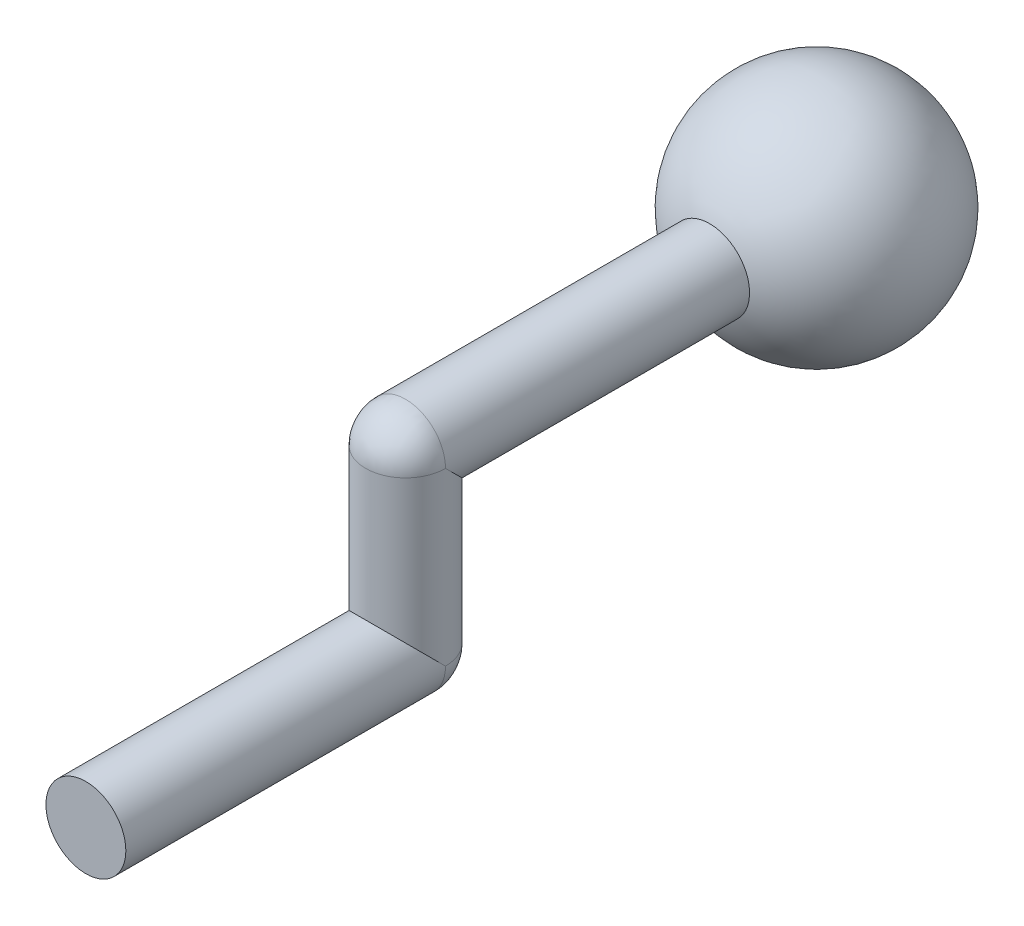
from build123d import *

# Parameters (mm, degrees)
ESQUISSE1_R      = 3.5
EXTRUSION1_DEPTH = 28
ESQUISSE2_R      = 3.5
EXTRUSION2_DEPTH = 15
ESQUISSE3_R      = 3.5
EXTRUSION3_DEPTH = 36


with BuildPart() as part:
    # Esquisse1 → Extrusion1 (new body)
    with BuildSketch(Plane.XY):
        Circle(ESQUISSE1_R)
    extrude(amount=EXTRUSION1_DEPTH)

    # Esquisse2 → Extrusion2 (add)
    with BuildSketch(Plane(origin=(0, 0, 0), x_dir=(1, 0, 0), z_dir=(0, 1, 0))):
        with Locations(Location((0, 0, 0), (0, 0, 180))):
            Circle(ESQUISSE2_R)
    extrude(amount=EXTRUSION2_DEPTH)

    # Esquisse3 → Extrusion3 (add)
    with BuildSketch(Plane.XY):
        with Locations((0, 15)):
            Circle(ESQUISSE3_R)
    extrude(amount=-EXTRUSION3_DEPTH)

    # Esquisse4 → R_volution2 (revolve)
    with BuildSketch(Plane(origin=(0, 0, 0), x_dir=(0, 0, -1), z_dir=(1, 0, 0))):
        with BuildLine():
            Line((36, 25), (36, 5))
            ThreePointArc((36, 5), (46, 15), (36, 25))
        make_face()
    revolve(axis=Axis((0, 8.165395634, -36), (0, 1, 0)))

    # Esquisse5 → R_volution3 (revolve)
    with BuildSketch(Plane.XY):
        with BuildLine():
            Line((-3.5, 15), (3.5, 15))
            ThreePointArc((3.5, 15), (0, 18.5), (-3.5, 15))
        make_face()
    revolve(axis=Axis((-12.956571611, 15, 0), (1, 0, 0)))

    # Esquisse6 → R_volution4 (revolve)
    with BuildSketch(Plane.XZ):
        with BuildLine():
            Line((3.5, 0), (-3.5, 0))
            ThreePointArc((-3.5, 0), (0, -3.5), (3.5, 0))
        make_face()
    revolve(axis=Axis((9.123833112, 0, 0), (-1, 0, 0)))


solid = part.part
